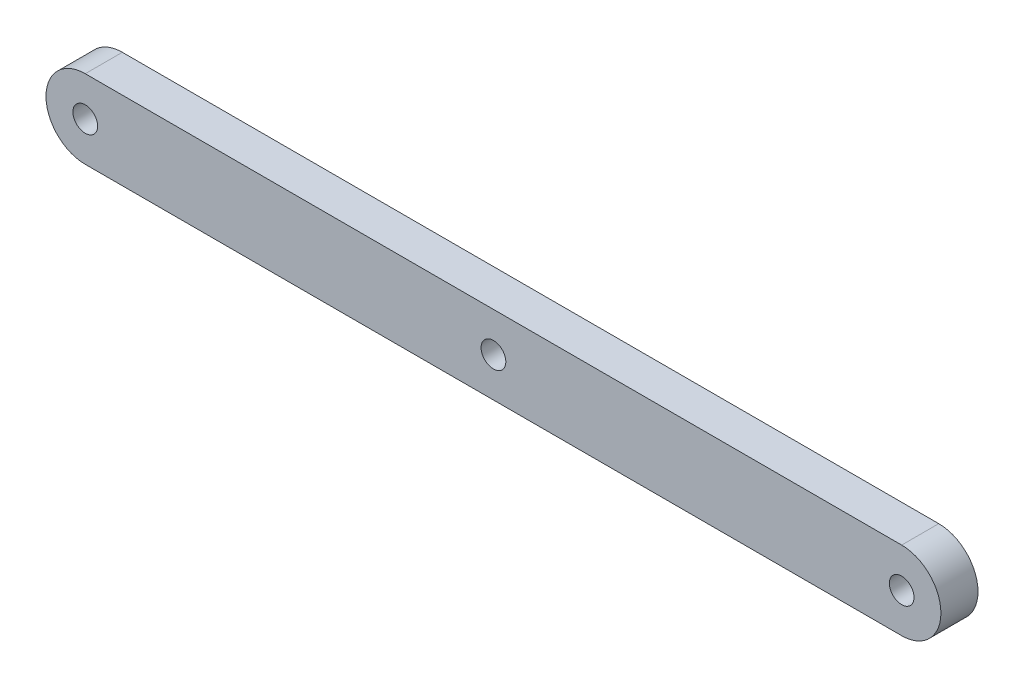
from build123d import *

# Parameters (mm, degrees)
SKETCH2_W           = 66.04
SKETCH2_H           = 6.35
EXTRUDE_THIN1_DEPTH = 3.000000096
SKETCH3_R           = 3.175
SKETCH3_R_2         = 1.000000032
BOSS_EXTRUDE1_DEPTH = 3
SKETCH3_2_R         = 1.000000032
CUT_EXTRUDE1_DEPTH  = 70.352698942


with BuildPart() as part:
    # Sketch2 → Extrude-Thin1 (new body)
    with BuildSketch(Plane.XY):
        with Locations((33.02, 0)):
            Rectangle(SKETCH2_W, SKETCH2_H)
    extrude(amount=EXTRUDE_THIN1_DEPTH)

    # Sketch3 → Boss-Extrude1 (add, through all)
    # profile 1 of 3: a face of its own
    with BuildSketch(Plane.XY.offset(3.000000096)):
        Circle(SKETCH3_R)
        Circle(SKETCH3_R_2, mode=Mode.SUBTRACT)
    # profile 2 of 3: a face of its own
    with BuildSketch(Plane.XY.offset(3.000000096)):
        with Locations((66.04, 0)):
            Circle(SKETCH3_R)
        with Locations((66.04, 0)):
            Circle(SKETCH3_R_2, mode=Mode.SUBTRACT)
    # profile 3 of 3: a face of its own
    with BuildSketch(Plane.XY.offset(3.000000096)):
        with Locations((33.02, 0)):
            Circle(SKETCH3_R_2)
    extrude(amount=-BOSS_EXTRUDE1_DEPTH)

    # Sketch3_2 → Cut-Extrude1 (cut, through all)
    with BuildSketch(Plane.XY.offset(3.000000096)):
        with BuildLine():
            Line((0, -1.000000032), (0, 1.000000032))
            ThreePointArc((0, 1.000000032), (-1.000000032, 0), (0, -1.000000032))
        make_face()
        with BuildLine():
            ThreePointArc((1.000000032, 0), (0.707106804, 0.707106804), (0, 1.000000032))
            Line((0, 1.000000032), (0, -1.000000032))
            ThreePointArc((0, -1.000000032), (0.707106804, -0.707106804), (1.000000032, 0))
        make_face()
        with BuildLine():
            Line((66.04, -1.000000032), (66.04, 1.000000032))
            ThreePointArc((66.04, 1.000000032), (65.039999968, 0), (66.04, -1.000000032))
        make_face()
        with BuildLine():
            ThreePointArc((67.040000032, 0), (66.747106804, 0.707106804), (66.04, 1.000000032))
            Line((66.04, 1.000000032), (66.04, -1.000000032))
            ThreePointArc((66.04, -1.000000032), (66.747106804, -0.707106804), (67.040000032, 0))
        make_face()
        with Locations((33.02, 0)):
            Circle(SKETCH3_2_R)
    extrude(amount=-CUT_EXTRUDE1_DEPTH, mode=Mode.SUBTRACT)


solid = part.part
